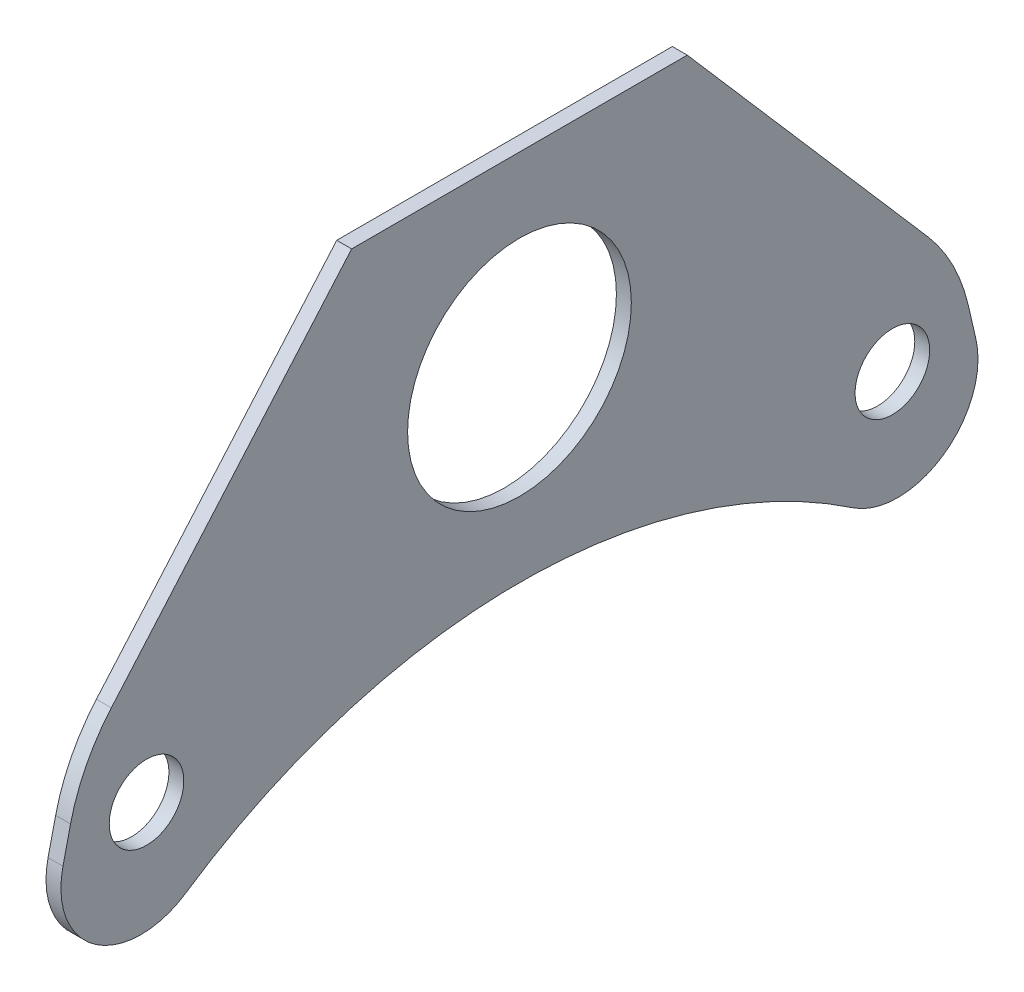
ISO-10303-21;
HEADER;
FILE_DESCRIPTION(('STEP AP214'),'2;1');
FILE_NAME('part.step','',(''),(''),'','','');
FILE_SCHEMA(('AUTOMOTIVE_DESIGN { 1 0 10303 214 1 1 1 1 }'));
ENDSEC;
DATA;
#1=APPLICATION_CONTEXT('core data for automotive mechanical design processes');
#2=APPLICATION_PROTOCOL_DEFINITION('international standard','automotive_design',2000,#1);
#3=PRODUCT_CONTEXT('',#1,'mechanical');
#4=PRODUCT('Part','Part','',(#3));
#5=PRODUCT_RELATED_PRODUCT_CATEGORY('part','',(#4));
#6=PRODUCT_DEFINITION_FORMATION('','',#4);
#7=PRODUCT_DEFINITION_CONTEXT('part definition',#1,'design');
#8=PRODUCT_DEFINITION('design','',#6,#7);
#9=PRODUCT_DEFINITION_SHAPE('','',#8);
#10=(LENGTH_UNIT() NAMED_UNIT(*) SI_UNIT(.MILLI.,.METRE.));
#11=(NAMED_UNIT(*) PLANE_ANGLE_UNIT() SI_UNIT($,.RADIAN.));
#12=(NAMED_UNIT(*) SI_UNIT($,.STERADIAN.) SOLID_ANGLE_UNIT());
#13=UNCERTAINTY_MEASURE_WITH_UNIT(LENGTH_MEASURE(1.E-05),#10,'distance_accuracy_value','');
#14=(GEOMETRIC_REPRESENTATION_CONTEXT(3) GLOBAL_UNCERTAINTY_ASSIGNED_CONTEXT((#13)) GLOBAL_UNIT_ASSIGNED_CONTEXT((#10,
#11,#12)) REPRESENTATION_CONTEXT('',''));
#15=CARTESIAN_POINT('',(0.,0.,0.));
#16=DIRECTION('',(0.,0.,1.));
#17=DIRECTION('',(1.,0.,0.));
#18=AXIS2_PLACEMENT_3D('',#15,#16,#17);
#19=CARTESIAN_POINT('',(0.799999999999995,-11.8991298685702,20.2901648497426));
#20=DIRECTION('',(-1.,0.,0.));
#21=DIRECTION('',(0.,0.,1.));
#22=AXIS2_PLACEMENT_3D('',#19,#20,#21);
#23=PLANE('',#22);
#24=CARTESIAN_POINT('',(0.799999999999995,-10.2,-20.));
#25=DIRECTION('',(1.,0.,0.));
#26=DIRECTION('',(0.,0.,-1.));
#27=AXIS2_PLACEMENT_3D('',#24,#25,#26);
#28=CIRCLE('',#27,2.);
#29=CARTESIAN_POINT('',(0.799999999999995,-10.2,-22.));
#30=VERTEX_POINT('',#29);
#31=EDGE_CURVE('E583',#30,#30,#28,.T.);
#32=ORIENTED_EDGE('',*,*,#31,.F.);
#33=EDGE_LOOP('',(#32));
#34=FACE_BOUND('',#33,.T.);
#35=CARTESIAN_POINT('',(0.799999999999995,-11.8991298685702,20.2901648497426));
#36=DIRECTION('',(1.,0.,0.));
#37=DIRECTION('',(0.,0.,1.));
#38=AXIS2_PLACEMENT_3D('',#35,#36,#37);
#39=CIRCLE('',#38,4.30087013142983);
#40=CARTESIAN_POINT('',(0.799999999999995,-10.931644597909,24.4808039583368));
#41=VERTEX_POINT('',#40);
#42=CARTESIAN_POINT('',(0.799999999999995,-15.4654337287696,17.8862179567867));
#43=VERTEX_POINT('',#42);
#44=EDGE_CURVE('E468',#41,#43,#39,.T.);
#45=ORIENTED_EDGE('',*,*,#44,.T.);
#46=CARTESIAN_POINT('',(0.799999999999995,-42.,0.));
#47=DIRECTION('',(-1.,0.,0.));
#48=DIRECTION('',(0.,0.,-1.));
#49=AXIS2_PLACEMENT_3D('',#46,#47,#48);
#50=CIRCLE('',#49,32.);
#51=CARTESIAN_POINT('',(0.799999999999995,-15.4654337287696,-17.8862179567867));
#52=VERTEX_POINT('',#51);
#53=EDGE_CURVE('E441',#43,#52,#50,.T.);
#54=ORIENTED_EDGE('',*,*,#53,.T.);
#55=CARTESIAN_POINT('',(0.799999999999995,-11.8991298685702,-20.2901648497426));
#56=DIRECTION('',(1.,0.,0.));
#57=DIRECTION('',(0.,0.,-1.));
#58=AXIS2_PLACEMENT_3D('',#55,#56,#57);
#59=CIRCLE('',#58,4.30087013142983);
#60=CARTESIAN_POINT('',(0.799999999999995,-10.931644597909,-24.4808039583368));
#61=VERTEX_POINT('',#60);
#62=EDGE_CURVE('E471',#52,#61,#59,.T.);
#63=ORIENTED_EDGE('',*,*,#62,.T.);
#64=DIRECTION('',(0.,0.974370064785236,0.224951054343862));
#65=VECTOR('',#64,1.);
#66=CARTESIAN_POINT('',(0.799999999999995,-9.16969463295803,-24.0740257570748));
#67=LINE('',#66,#65);
#68=CARTESIAN_POINT('',(0.799999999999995,-9.16969463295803,-24.0740257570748));
#69=VERTEX_POINT('',#68);
#70=EDGE_CURVE('E473',#61,#69,#67,.T.);
#71=ORIENTED_EDGE('',*,*,#70,.T.);
#72=CARTESIAN_POINT('',(0.799999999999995,-11.4192051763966,-14.3303251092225));
#73=DIRECTION('',(1.,0.,0.));
#74=DIRECTION('',(0.,0.,-1.));
#75=AXIS2_PLACEMENT_3D('',#72,#73,#74);
#76=CIRCLE('',#75,10.);
#77=CARTESIAN_POINT('',(0.799999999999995,-4.86990865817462,-21.8872236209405));
#78=VERTEX_POINT('',#77);
#79=EDGE_CURVE('E475',#69,#78,#76,.T.);
#80=ORIENTED_EDGE('',*,*,#79,.T.);
#81=DIRECTION('',(0.,0.7556898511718,0.654929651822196));
#82=VECTOR('',#81,1.);
#83=CARTESIAN_POINT('',(0.799999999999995,10.,-9.00000000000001));
#84=LINE('',#83,#82);
#85=CARTESIAN_POINT('',(0.799999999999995,10.,-9.00000000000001));
#86=VERTEX_POINT('',#85);
#87=EDGE_CURVE('E477',#78,#86,#84,.T.);
#88=ORIENTED_EDGE('',*,*,#87,.T.);
#89=DIRECTION('',(0.,0.,1.));
#90=VECTOR('',#89,1.);
#91=CARTESIAN_POINT('',(0.799999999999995,10.,8.99999999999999));
#92=LINE('',#91,#90);
#93=CARTESIAN_POINT('',(0.799999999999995,10.,8.99999999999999));
#94=VERTEX_POINT('',#93);
#95=EDGE_CURVE('E479',#86,#94,#92,.T.);
#96=ORIENTED_EDGE('',*,*,#95,.T.);
#97=DIRECTION('',(0.,-0.7556898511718,0.654929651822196));
#98=VECTOR('',#97,1.);
#99=CARTESIAN_POINT('',(0.799999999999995,10.,8.99999999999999));
#100=LINE('',#99,#98);
#101=CARTESIAN_POINT('',(0.799999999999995,-4.86990865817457,21.8872236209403));
#102=VERTEX_POINT('',#101);
#103=EDGE_CURVE('E481',#94,#102,#100,.T.);
#104=ORIENTED_EDGE('',*,*,#103,.T.);
#105=CARTESIAN_POINT('',(0.799999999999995,-11.4192051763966,14.3303251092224));
#106=DIRECTION('',(1.,0.,0.));
#107=DIRECTION('',(0.,0.,1.));
#108=AXIS2_PLACEMENT_3D('',#105,#106,#107);
#109=CIRCLE('',#108,10.);
#110=CARTESIAN_POINT('',(0.799999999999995,-9.16969463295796,24.0740257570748));
#111=VERTEX_POINT('',#110);
#112=EDGE_CURVE('E370',#102,#111,#109,.T.);
#113=ORIENTED_EDGE('',*,*,#112,.T.);
#114=DIRECTION('',(0.,-0.974370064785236,0.224951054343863));
#115=VECTOR('',#114,1.);
#116=CARTESIAN_POINT('',(0.799999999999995,-9.16969463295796,24.0740257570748));
#117=LINE('',#116,#115);
#118=EDGE_CURVE('E365',#111,#41,#117,.T.);
#119=ORIENTED_EDGE('',*,*,#118,.T.);
#120=EDGE_LOOP('',(#45,#54,#63,#71,#80,#88,#96,#104,#113,#119));
#121=FACE_BOUND('',#120,.T.);
#122=CARTESIAN_POINT('',(0.799999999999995,0.,0.));
#123=DIRECTION('',(1.,0.,0.));
#124=DIRECTION('',(0.,0.,-1.));
#125=AXIS2_PLACEMENT_3D('',#122,#123,#124);
#126=CIRCLE('',#125,6.);
#127=CARTESIAN_POINT('',(0.799999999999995,0.,-6.));
#128=VERTEX_POINT('',#127);
#129=EDGE_CURVE('E446',#128,#128,#126,.T.);
#130=ORIENTED_EDGE('',*,*,#129,.F.);
#131=EDGE_LOOP('',(#130));
#132=FACE_BOUND('',#131,.T.);
#133=CARTESIAN_POINT('',(0.799999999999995,-10.2,20.));
#134=DIRECTION('',(1.,0.,0.));
#135=DIRECTION('',(0.,0.,1.));
#136=AXIS2_PLACEMENT_3D('',#133,#134,#135);
#137=CIRCLE('',#136,2.);
#138=CARTESIAN_POINT('',(0.799999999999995,-10.2,22.));
#139=VERTEX_POINT('',#138);
#140=EDGE_CURVE('E572',#139,#139,#137,.T.);
#141=ORIENTED_EDGE('',*,*,#140,.F.);
#142=EDGE_LOOP('',(#141));
#143=FACE_BOUND('',#142,.T.);
#144=ADVANCED_FACE('F350',(#34,#121,#132,#143),#23,.F.);
#145=CARTESIAN_POINT('',(0.,-11.8991298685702,20.2901648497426));
#146=DIRECTION('',(-1.,0.,0.));
#147=DIRECTION('',(0.,0.,1.));
#148=AXIS2_PLACEMENT_3D('',#145,#146,#147);
#149=PLANE('',#148);
#150=CARTESIAN_POINT('',(0.,-10.2,-20.));
#151=DIRECTION('',(1.,0.,0.));
#152=DIRECTION('',(0.,0.,-1.));
#153=AXIS2_PLACEMENT_3D('',#150,#151,#152);
#154=CIRCLE('',#153,2.);
#155=CARTESIAN_POINT('',(0.,-10.2,-22.));
#156=VERTEX_POINT('',#155);
#157=EDGE_CURVE('E578',#156,#156,#154,.T.);
#158=ORIENTED_EDGE('',*,*,#157,.T.);
#159=EDGE_LOOP('',(#158));
#160=FACE_BOUND('',#159,.T.);
#161=CARTESIAN_POINT('',(0.,-11.8991298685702,20.2901648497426));
#162=DIRECTION('',(1.,0.,0.));
#163=DIRECTION('',(0.,0.,1.));
#164=AXIS2_PLACEMENT_3D('',#161,#162,#163);
#165=CIRCLE('',#164,4.30087013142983);
#166=CARTESIAN_POINT('',(0.,-10.931644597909,24.4808039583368));
#167=VERTEX_POINT('',#166);
#168=CARTESIAN_POINT('',(0.,-15.4654337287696,17.8862179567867));
#169=VERTEX_POINT('',#168);
#170=EDGE_CURVE('E432',#167,#169,#165,.T.);
#171=ORIENTED_EDGE('',*,*,#170,.F.);
#172=DIRECTION('',(0.,-0.974370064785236,0.224951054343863));
#173=VECTOR('',#172,1.);
#174=CARTESIAN_POINT('',(0.,-9.16969463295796,24.0740257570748));
#175=LINE('',#174,#173);
#176=CARTESIAN_POINT('',(0.,-9.16969463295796,24.0740257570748));
#177=VERTEX_POINT('',#176);
#178=EDGE_CURVE('E466',#177,#167,#175,.T.);
#179=ORIENTED_EDGE('',*,*,#178,.F.);
#180=CARTESIAN_POINT('',(0.,-11.4192051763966,14.3303251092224));
#181=DIRECTION('',(1.,0.,0.));
#182=DIRECTION('',(0.,0.,1.));
#183=AXIS2_PLACEMENT_3D('',#180,#181,#182);
#184=CIRCLE('',#183,10.);
#185=CARTESIAN_POINT('',(0.,-4.86990865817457,21.8872236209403));
#186=VERTEX_POINT('',#185);
#187=EDGE_CURVE('E464',#186,#177,#184,.T.);
#188=ORIENTED_EDGE('',*,*,#187,.F.);
#189=DIRECTION('',(0.,-0.7556898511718,0.654929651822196));
#190=VECTOR('',#189,1.);
#191=CARTESIAN_POINT('',(0.,10.,8.99999999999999));
#192=LINE('',#191,#190);
#193=CARTESIAN_POINT('',(0.,10.,8.99999999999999));
#194=VERTEX_POINT('',#193);
#195=EDGE_CURVE('E462',#194,#186,#192,.T.);
#196=ORIENTED_EDGE('',*,*,#195,.F.);
#197=DIRECTION('',(0.,0.,1.));
#198=VECTOR('',#197,1.);
#199=CARTESIAN_POINT('',(0.,10.,8.99999999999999));
#200=LINE('',#199,#198);
#201=CARTESIAN_POINT('',(0.,10.,-9.00000000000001));
#202=VERTEX_POINT('',#201);
#203=EDGE_CURVE('E460',#202,#194,#200,.T.);
#204=ORIENTED_EDGE('',*,*,#203,.F.);
#205=DIRECTION('',(0.,0.7556898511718,0.654929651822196));
#206=VECTOR('',#205,1.);
#207=CARTESIAN_POINT('',(0.,10.,-9.00000000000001));
#208=LINE('',#207,#206);
#209=CARTESIAN_POINT('',(0.,-4.86990865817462,-21.8872236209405));
#210=VERTEX_POINT('',#209);
#211=EDGE_CURVE('E458',#210,#202,#208,.T.);
#212=ORIENTED_EDGE('',*,*,#211,.F.);
#213=CARTESIAN_POINT('',(0.,-11.4192051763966,-14.3303251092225));
#214=DIRECTION('',(1.,0.,0.));
#215=DIRECTION('',(0.,0.,-1.));
#216=AXIS2_PLACEMENT_3D('',#213,#214,#215);
#217=CIRCLE('',#216,10.);
#218=CARTESIAN_POINT('',(0.,-9.16969463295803,-24.0740257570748));
#219=VERTEX_POINT('',#218);
#220=EDGE_CURVE('E456',#219,#210,#217,.T.);
#221=ORIENTED_EDGE('',*,*,#220,.F.);
#222=DIRECTION('',(0.,0.974370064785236,0.224951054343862));
#223=VECTOR('',#222,1.);
#224=CARTESIAN_POINT('',(0.,-9.16969463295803,-24.0740257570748));
#225=LINE('',#224,#223);
#226=CARTESIAN_POINT('',(0.,-10.931644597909,-24.4808039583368));
#227=VERTEX_POINT('',#226);
#228=EDGE_CURVE('E454',#227,#219,#225,.T.);
#229=ORIENTED_EDGE('',*,*,#228,.F.);
#230=CARTESIAN_POINT('',(0.,-11.8991298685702,-20.2901648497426));
#231=DIRECTION('',(1.,0.,0.));
#232=DIRECTION('',(0.,0.,-1.));
#233=AXIS2_PLACEMENT_3D('',#230,#231,#232);
#234=CIRCLE('',#233,4.30087013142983);
#235=CARTESIAN_POINT('',(0.,-15.4654337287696,-17.8862179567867));
#236=VERTEX_POINT('',#235);
#237=EDGE_CURVE('E434',#236,#227,#234,.T.);
#238=ORIENTED_EDGE('',*,*,#237,.F.);
#239=CARTESIAN_POINT('',(0.,-42.,0.));
#240=DIRECTION('',(-1.,0.,0.));
#241=DIRECTION('',(0.,0.,-1.));
#242=AXIS2_PLACEMENT_3D('',#239,#240,#241);
#243=CIRCLE('',#242,32.);
#244=EDGE_CURVE('E427',#169,#236,#243,.T.);
#245=ORIENTED_EDGE('',*,*,#244,.F.);
#246=EDGE_LOOP('',(#171,#179,#188,#196,#204,#212,#221,#229,#238,#245));
#247=FACE_BOUND('',#246,.T.);
#248=CARTESIAN_POINT('',(0.,0.,0.));
#249=DIRECTION('',(1.,0.,0.));
#250=DIRECTION('',(0.,0.,-1.));
#251=AXIS2_PLACEMENT_3D('',#248,#249,#250);
#252=CIRCLE('',#251,6.);
#253=CARTESIAN_POINT('',(0.,0.,-6.));
#254=VERTEX_POINT('',#253);
#255=EDGE_CURVE('E449',#254,#254,#252,.T.);
#256=ORIENTED_EDGE('',*,*,#255,.T.);
#257=EDGE_LOOP('',(#256));
#258=FACE_BOUND('',#257,.T.);
#259=CARTESIAN_POINT('',(0.,-10.2,20.));
#260=DIRECTION('',(1.,0.,0.));
#261=DIRECTION('',(0.,0.,1.));
#262=AXIS2_PLACEMENT_3D('',#259,#260,#261);
#263=CIRCLE('',#262,2.);
#264=CARTESIAN_POINT('',(0.,-10.2,22.));
#265=VERTEX_POINT('',#264);
#266=EDGE_CURVE('E575',#265,#265,#263,.T.);
#267=ORIENTED_EDGE('',*,*,#266,.T.);
#268=EDGE_LOOP('',(#267));
#269=FACE_BOUND('',#268,.T.);
#270=ADVANCED_FACE('F428',(#160,#247,#258,#269),#149,.T.);
#271=CARTESIAN_POINT('',(0.799999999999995,-11.8991298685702,20.2901648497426));
#272=DIRECTION('',(-1.,0.,0.));
#273=DIRECTION('',(0.,0.,1.));
#274=AXIS2_PLACEMENT_3D('',#271,#272,#273);
#275=CYLINDRICAL_SURFACE('',#274,4.30087013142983);
#276=ORIENTED_EDGE('',*,*,#170,.T.);
#277=DIRECTION('',(-1.,0.,0.));
#278=VECTOR('',#277,1.);
#279=CARTESIAN_POINT('',(0.799999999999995,-15.4654337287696,17.8862179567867));
#280=LINE('',#279,#278);
#281=EDGE_CURVE('E11',#43,#169,#280,.T.);
#282=ORIENTED_EDGE('',*,*,#281,.F.);
#283=ORIENTED_EDGE('',*,*,#44,.F.);
#284=DIRECTION('',(-1.,0.,0.));
#285=VECTOR('',#284,1.);
#286=CARTESIAN_POINT('',(0.799999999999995,-10.931644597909,24.4808039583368));
#287=LINE('',#286,#285);
#288=EDGE_CURVE('E445',#41,#167,#287,.T.);
#289=ORIENTED_EDGE('',*,*,#288,.T.);
#290=EDGE_LOOP('',(#276,#282,#283,#289));
#291=FACE_BOUND('',#290,.T.);
#292=ADVANCED_FACE('F352',(#291),#275,.T.);
#293=CARTESIAN_POINT('',(0.799999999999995,-42.,0.));
#294=DIRECTION('',(-1.,0.,0.));
#295=DIRECTION('',(0.,0.,1.));
#296=AXIS2_PLACEMENT_3D('',#293,#294,#295);
#297=CYLINDRICAL_SURFACE('',#296,32.);
#298=ORIENTED_EDGE('',*,*,#244,.T.);
#299=DIRECTION('',(-1.,0.,0.));
#300=VECTOR('',#299,1.);
#301=CARTESIAN_POINT('',(0.799999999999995,-15.4654337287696,-17.8862179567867));
#302=LINE('',#301,#300);
#303=EDGE_CURVE('E358',#52,#236,#302,.T.);
#304=ORIENTED_EDGE('',*,*,#303,.F.);
#305=ORIENTED_EDGE('',*,*,#53,.F.);
#306=ORIENTED_EDGE('',*,*,#281,.T.);
#307=EDGE_LOOP('',(#298,#304,#305,#306));
#308=FACE_BOUND('',#307,.T.);
#309=ADVANCED_FACE('F440',(#308),#297,.F.);
#310=CARTESIAN_POINT('',(0.799999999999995,-11.8991298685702,-20.2901648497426));
#311=DIRECTION('',(-1.,0.,0.));
#312=DIRECTION('',(0.,0.,1.));
#313=AXIS2_PLACEMENT_3D('',#310,#311,#312);
#314=CYLINDRICAL_SURFACE('',#313,4.30087013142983);
#315=ORIENTED_EDGE('',*,*,#237,.T.);
#316=DIRECTION('',(-1.,0.,0.));
#317=VECTOR('',#316,1.);
#318=CARTESIAN_POINT('',(0.799999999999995,-10.931644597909,-24.4808039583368));
#319=LINE('',#318,#317);
#320=EDGE_CURVE('E504',#61,#227,#319,.T.);
#321=ORIENTED_EDGE('',*,*,#320,.F.);
#322=ORIENTED_EDGE('',*,*,#62,.F.);
#323=ORIENTED_EDGE('',*,*,#303,.T.);
#324=EDGE_LOOP('',(#315,#321,#322,#323));
#325=FACE_BOUND('',#324,.T.);
#326=ADVANCED_FACE('F508',(#325),#314,.T.);
#327=CARTESIAN_POINT('',(0.799999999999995,-9.16969463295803,-24.0740257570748));
#328=DIRECTION('',(0.,-0.224951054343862,0.974370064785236));
#329=DIRECTION('',(0.,-0.974370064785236,-0.224951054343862));
#330=AXIS2_PLACEMENT_3D('',#327,#328,#329);
#331=PLANE('',#330);
#332=ORIENTED_EDGE('',*,*,#228,.T.);
#333=DIRECTION('',(-1.,0.,0.));
#334=VECTOR('',#333,1.);
#335=CARTESIAN_POINT('',(0.799999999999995,-9.16969463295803,-24.0740257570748));
#336=LINE('',#335,#334);
#337=EDGE_CURVE('E501',#69,#219,#336,.T.);
#338=ORIENTED_EDGE('',*,*,#337,.F.);
#339=ORIENTED_EDGE('',*,*,#70,.F.);
#340=ORIENTED_EDGE('',*,*,#320,.T.);
#341=EDGE_LOOP('',(#332,#338,#339,#340));
#342=FACE_BOUND('',#341,.T.);
#343=ADVANCED_FACE('F516',(#342),#331,.F.);
#344=CARTESIAN_POINT('',(0.799999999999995,-11.4192051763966,-14.3303251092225));
#345=DIRECTION('',(-1.,0.,0.));
#346=DIRECTION('',(0.,0.,1.));
#347=AXIS2_PLACEMENT_3D('',#344,#345,#346);
#348=CYLINDRICAL_SURFACE('',#347,10.);
#349=ORIENTED_EDGE('',*,*,#220,.T.);
#350=DIRECTION('',(-1.,0.,0.));
#351=VECTOR('',#350,1.);
#352=CARTESIAN_POINT('',(0.799999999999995,-4.86990865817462,-21.8872236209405));
#353=LINE('',#352,#351);
#354=EDGE_CURVE('E498',#78,#210,#353,.T.);
#355=ORIENTED_EDGE('',*,*,#354,.F.);
#356=ORIENTED_EDGE('',*,*,#79,.F.);
#357=ORIENTED_EDGE('',*,*,#337,.T.);
#358=EDGE_LOOP('',(#349,#355,#356,#357));
#359=FACE_BOUND('',#358,.T.);
#360=ADVANCED_FACE('F519',(#359),#348,.T.);
#361=CARTESIAN_POINT('',(0.799999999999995,10.,-9.00000000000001));
#362=DIRECTION('',(0.,-0.654929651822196,0.7556898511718));
#363=DIRECTION('',(0.,-0.7556898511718,-0.654929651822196));
#364=AXIS2_PLACEMENT_3D('',#361,#362,#363);
#365=PLANE('',#364);
#366=ORIENTED_EDGE('',*,*,#211,.T.);
#367=DIRECTION('',(-1.,0.,0.));
#368=VECTOR('',#367,1.);
#369=CARTESIAN_POINT('',(0.799999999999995,10.,-9.00000000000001));
#370=LINE('',#369,#368);
#371=EDGE_CURVE('E495',#86,#202,#370,.T.);
#372=ORIENTED_EDGE('',*,*,#371,.F.);
#373=ORIENTED_EDGE('',*,*,#87,.F.);
#374=ORIENTED_EDGE('',*,*,#354,.T.);
#375=EDGE_LOOP('',(#366,#372,#373,#374));
#376=FACE_BOUND('',#375,.T.);
#377=ADVANCED_FACE('F524',(#376),#365,.F.);
#378=CARTESIAN_POINT('',(0.799999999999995,10.,8.99999999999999));
#379=DIRECTION('',(0.,-1.,0.));
#380=DIRECTION('',(0.,0.,-1.));
#381=AXIS2_PLACEMENT_3D('',#378,#379,#380);
#382=PLANE('',#381);
#383=ORIENTED_EDGE('',*,*,#203,.T.);
#384=DIRECTION('',(-1.,0.,0.));
#385=VECTOR('',#384,1.);
#386=CARTESIAN_POINT('',(0.799999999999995,10.,8.99999999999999));
#387=LINE('',#386,#385);
#388=EDGE_CURVE('E492',#94,#194,#387,.T.);
#389=ORIENTED_EDGE('',*,*,#388,.F.);
#390=ORIENTED_EDGE('',*,*,#95,.F.);
#391=ORIENTED_EDGE('',*,*,#371,.T.);
#392=EDGE_LOOP('',(#383,#389,#390,#391));
#393=FACE_BOUND('',#392,.T.);
#394=ADVANCED_FACE('F530',(#393),#382,.F.);
#395=CARTESIAN_POINT('',(0.799999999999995,10.,8.99999999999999));
#396=DIRECTION('',(0.,-0.654929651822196,-0.7556898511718));
#397=DIRECTION('',(0.,0.7556898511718,-0.654929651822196));
#398=AXIS2_PLACEMENT_3D('',#395,#396,#397);
#399=PLANE('',#398);
#400=ORIENTED_EDGE('',*,*,#195,.T.);
#401=DIRECTION('',(-1.,0.,0.));
#402=VECTOR('',#401,1.);
#403=CARTESIAN_POINT('',(0.799999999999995,-4.86990865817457,21.8872236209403));
#404=LINE('',#403,#402);
#405=EDGE_CURVE('E489',#102,#186,#404,.T.);
#406=ORIENTED_EDGE('',*,*,#405,.F.);
#407=ORIENTED_EDGE('',*,*,#103,.F.);
#408=ORIENTED_EDGE('',*,*,#388,.T.);
#409=EDGE_LOOP('',(#400,#406,#407,#408));
#410=FACE_BOUND('',#409,.T.);
#411=ADVANCED_FACE('F534',(#410),#399,.F.);
#412=CARTESIAN_POINT('',(0.799999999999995,-11.4192051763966,14.3303251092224));
#413=DIRECTION('',(-1.,0.,0.));
#414=DIRECTION('',(0.,0.,1.));
#415=AXIS2_PLACEMENT_3D('',#412,#413,#414);
#416=CYLINDRICAL_SURFACE('',#415,10.);
#417=ORIENTED_EDGE('',*,*,#187,.T.);
#418=DIRECTION('',(-1.,0.,0.));
#419=VECTOR('',#418,1.);
#420=CARTESIAN_POINT('',(0.799999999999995,-9.16969463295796,24.0740257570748));
#421=LINE('',#420,#419);
#422=EDGE_CURVE('E486',#111,#177,#421,.T.);
#423=ORIENTED_EDGE('',*,*,#422,.F.);
#424=ORIENTED_EDGE('',*,*,#112,.F.);
#425=ORIENTED_EDGE('',*,*,#405,.T.);
#426=EDGE_LOOP('',(#417,#423,#424,#425));
#427=FACE_BOUND('',#426,.T.);
#428=ADVANCED_FACE('F537',(#427),#416,.T.);
#429=CARTESIAN_POINT('',(0.799999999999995,-9.16969463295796,24.0740257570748));
#430=DIRECTION('',(0.,-0.224951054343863,-0.974370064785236));
#431=DIRECTION('',(0.,0.974370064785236,-0.224951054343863));
#432=AXIS2_PLACEMENT_3D('',#429,#430,#431);
#433=PLANE('',#432);
#434=ORIENTED_EDGE('',*,*,#178,.T.);
#435=ORIENTED_EDGE('',*,*,#288,.F.);
#436=ORIENTED_EDGE('',*,*,#118,.F.);
#437=ORIENTED_EDGE('',*,*,#422,.T.);
#438=EDGE_LOOP('',(#434,#435,#436,#437));
#439=FACE_BOUND('',#438,.T.);
#440=ADVANCED_FACE('F539',(#439),#433,.F.);
#441=CARTESIAN_POINT('',(0.799999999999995,0.,0.));
#442=DIRECTION('',(-1.,0.,0.));
#443=DIRECTION('',(0.,0.,1.));
#444=AXIS2_PLACEMENT_3D('',#441,#442,#443);
#445=CYLINDRICAL_SURFACE('',#444,6.);
#446=ORIENTED_EDGE('',*,*,#129,.T.);
#447=EDGE_LOOP('',(#446));
#448=FACE_BOUND('',#447,.T.);
#449=ORIENTED_EDGE('',*,*,#255,.F.);
#450=EDGE_LOOP('',(#449));
#451=FACE_BOUND('',#450,.T.);
#452=ADVANCED_FACE('F541',(#448,#451),#445,.F.);
#453=CARTESIAN_POINT('',(0.799999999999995,-10.2,-20.));
#454=DIRECTION('',(-1.,0.,0.));
#455=DIRECTION('',(0.,0.,1.));
#456=AXIS2_PLACEMENT_3D('',#453,#454,#455);
#457=CYLINDRICAL_SURFACE('',#456,2.);
#458=ORIENTED_EDGE('',*,*,#31,.T.);
#459=EDGE_LOOP('',(#458));
#460=FACE_BOUND('',#459,.T.);
#461=ORIENTED_EDGE('',*,*,#157,.F.);
#462=EDGE_LOOP('',(#461));
#463=FACE_BOUND('',#462,.T.);
#464=ADVANCED_FACE('F547',(#460,#463),#457,.F.);
#465=CARTESIAN_POINT('',(0.799999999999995,-10.2,20.));
#466=DIRECTION('',(-1.,0.,0.));
#467=DIRECTION('',(0.,0.,1.));
#468=AXIS2_PLACEMENT_3D('',#465,#466,#467);
#469=CYLINDRICAL_SURFACE('',#468,2.);
#470=ORIENTED_EDGE('',*,*,#140,.T.);
#471=EDGE_LOOP('',(#470));
#472=FACE_BOUND('',#471,.T.);
#473=ORIENTED_EDGE('',*,*,#266,.F.);
#474=EDGE_LOOP('',(#473));
#475=FACE_BOUND('',#474,.T.);
#476=ADVANCED_FACE('F563',(#472,#475),#469,.F.);
#477=CLOSED_SHELL('',(#144,#270,#292,#309,#326,#343,#360,#377,#394,#411,#428,#440,#452,#464,#476));
#478=MANIFOLD_SOLID_BREP('B2',#477);
#479=ADVANCED_BREP_SHAPE_REPRESENTATION('',(#18,#478),#14);
#480=SHAPE_DEFINITION_REPRESENTATION(#9,#479);
ENDSEC;
END-ISO-10303-21;
